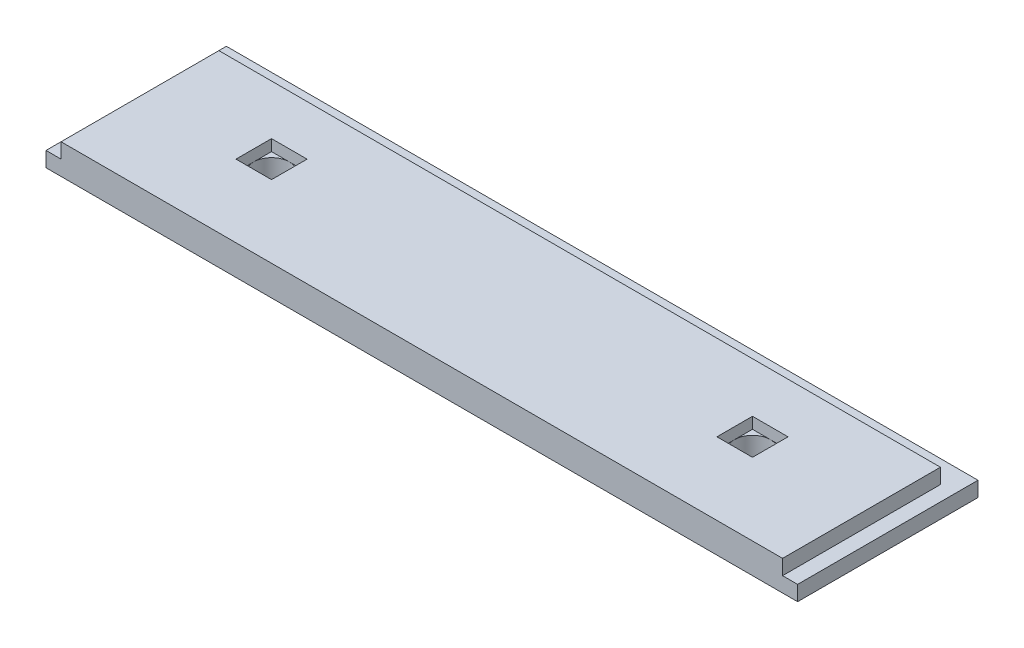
ISO-10303-21;
HEADER;
FILE_DESCRIPTION(('STEP AP214'),'2;1');
FILE_NAME('part.step','',(''),(''),'','','');
FILE_SCHEMA(('AUTOMOTIVE_DESIGN { 1 0 10303 214 1 1 1 1 }'));
ENDSEC;
DATA;
#1=APPLICATION_CONTEXT('core data for automotive mechanical design processes');
#2=APPLICATION_PROTOCOL_DEFINITION('international standard','automotive_design',2000,#1);
#3=PRODUCT_CONTEXT('',#1,'mechanical');
#4=PRODUCT('Part','Part','',(#3));
#5=PRODUCT_RELATED_PRODUCT_CATEGORY('part','',(#4));
#6=PRODUCT_DEFINITION_FORMATION('','',#4);
#7=PRODUCT_DEFINITION_CONTEXT('part definition',#1,'design');
#8=PRODUCT_DEFINITION('design','',#6,#7);
#9=PRODUCT_DEFINITION_SHAPE('','',#8);
#10=(LENGTH_UNIT() NAMED_UNIT(*) SI_UNIT(.MILLI.,.METRE.));
#11=(NAMED_UNIT(*) PLANE_ANGLE_UNIT() SI_UNIT($,.RADIAN.));
#12=(NAMED_UNIT(*) SI_UNIT($,.STERADIAN.) SOLID_ANGLE_UNIT());
#13=UNCERTAINTY_MEASURE_WITH_UNIT(LENGTH_MEASURE(1.E-05),#10,'distance_accuracy_value','');
#14=(GEOMETRIC_REPRESENTATION_CONTEXT(3) GLOBAL_UNCERTAINTY_ASSIGNED_CONTEXT((#13)) GLOBAL_UNIT_ASSIGNED_CONTEXT((#10,
#11,#12)) REPRESENTATION_CONTEXT('',''));
#15=CARTESIAN_POINT('',(0.,0.,0.));
#16=DIRECTION('',(0.,0.,1.));
#17=DIRECTION('',(1.,0.,0.));
#18=AXIS2_PLACEMENT_3D('',#15,#16,#17);
#19=CARTESIAN_POINT('',(2489.2,50.8000000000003,609.6));
#20=DIRECTION('',(-1.,0.,0.));
#21=DIRECTION('',(0.,0.,1.));
#22=AXIS2_PLACEMENT_3D('',#19,#20,#21);
#23=PLANE('',#22);
#24=DIRECTION('',(0.,-1.,0.));
#25=VECTOR('',#24,1.);
#26=CARTESIAN_POINT('',(2489.2,101.6,76.2));
#27=LINE('',#26,#25);
#28=CARTESIAN_POINT('',(2489.2,101.6,76.2));
#29=VERTEX_POINT('',#28);
#30=CARTESIAN_POINT('',(2489.2,50.8000000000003,76.2));
#31=VERTEX_POINT('',#30);
#32=EDGE_CURVE('E186',#29,#31,#27,.T.);
#33=ORIENTED_EDGE('',*,*,#32,.F.);
#34=DIRECTION('',(0.,0.,-1.));
#35=VECTOR('',#34,1.);
#36=CARTESIAN_POINT('',(2489.2,101.6,609.6));
#37=LINE('',#36,#35);
#38=CARTESIAN_POINT('',(2489.2,101.6,609.6));
#39=VERTEX_POINT('',#38);
#40=EDGE_CURVE('E195',#39,#29,#37,.T.);
#41=ORIENTED_EDGE('',*,*,#40,.F.);
#42=DIRECTION('',(0.,1.,0.));
#43=VECTOR('',#42,1.);
#44=CARTESIAN_POINT('',(2489.2,50.8000000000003,609.6));
#45=LINE('',#44,#43);
#46=CARTESIAN_POINT('',(2489.2,50.8000000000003,609.6));
#47=VERTEX_POINT('',#46);
#48=EDGE_CURVE('E193',#47,#39,#45,.T.);
#49=ORIENTED_EDGE('',*,*,#48,.F.);
#50=DIRECTION('',(0.,0.,-1.));
#51=VECTOR('',#50,1.);
#52=CARTESIAN_POINT('',(2489.2,50.8000000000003,609.6));
#53=LINE('',#52,#51);
#54=EDGE_CURVE('E175',#47,#31,#53,.T.);
#55=ORIENTED_EDGE('',*,*,#54,.T.);
#56=EDGE_LOOP('',(#33,#41,#49,#55));
#57=FACE_BOUND('',#56,.T.);
#58=ADVANCED_FACE('F32',(#57),#23,.F.);
#59=CARTESIAN_POINT('',(2489.2,101.6,609.6));
#60=DIRECTION('',(0.,-1.,0.));
#61=DIRECTION('',(1.,0.,0.));
#62=AXIS2_PLACEMENT_3D('',#59,#60,#61);
#63=PLANE('',#62);
#64=DIRECTION('',(1.,0.,0.));
#65=VECTOR('',#64,1.);
#66=CARTESIAN_POINT('',(2022.602,101.6,364.871));
#67=LINE('',#66,#65);
#68=CARTESIAN_POINT('',(2022.602,101.6,364.871));
#69=VERTEX_POINT('',#68);
#70=CARTESIAN_POINT('',(2142.744,101.6,364.871));
#71=VERTEX_POINT('',#70);
#72=EDGE_CURVE('E330',#69,#71,#67,.T.);
#73=ORIENTED_EDGE('',*,*,#72,.F.);
#74=DIRECTION('',(0.,0.,1.));
#75=VECTOR('',#74,1.);
#76=CARTESIAN_POINT('',(2022.602,101.6,244.729));
#77=LINE('',#76,#75);
#78=CARTESIAN_POINT('',(2022.602,101.6,244.729));
#79=VERTEX_POINT('',#78);
#80=EDGE_CURVE('E274',#79,#69,#77,.T.);
#81=ORIENTED_EDGE('',*,*,#80,.F.);
#82=DIRECTION('',(-1.,0.,0.));
#83=VECTOR('',#82,1.);
#84=CARTESIAN_POINT('',(2022.602,101.6,244.729));
#85=LINE('',#84,#83);
#86=CARTESIAN_POINT('',(2142.744,101.6,244.729));
#87=VERTEX_POINT('',#86);
#88=EDGE_CURVE('E336',#87,#79,#85,.T.);
#89=ORIENTED_EDGE('',*,*,#88,.F.);
#90=DIRECTION('',(0.,0.,-1.));
#91=VECTOR('',#90,1.);
#92=CARTESIAN_POINT('',(2142.744,101.6,244.729));
#93=LINE('',#92,#91);
#94=EDGE_CURVE('E333',#71,#87,#93,.T.);
#95=ORIENTED_EDGE('',*,*,#94,.F.);
#96=EDGE_LOOP('',(#73,#81,#89,#95));
#97=FACE_BOUND('',#96,.T.);
#98=DIRECTION('',(1.,0.,0.));
#99=VECTOR('',#98,1.);
#100=CARTESIAN_POINT('',(397.256,101.6,364.871));
#101=LINE('',#100,#99);
#102=CARTESIAN_POINT('',(397.256,101.6,364.871));
#103=VERTEX_POINT('',#102);
#104=CARTESIAN_POINT('',(517.398,101.6,364.871));
#105=VERTEX_POINT('',#104);
#106=EDGE_CURVE('E294',#103,#105,#101,.T.);
#107=ORIENTED_EDGE('',*,*,#106,.F.);
#108=DIRECTION('',(0.,0.,1.));
#109=VECTOR('',#108,1.);
#110=CARTESIAN_POINT('',(397.256,101.6,244.729));
#111=LINE('',#110,#109);
#112=CARTESIAN_POINT('',(397.256,101.6,244.729));
#113=VERTEX_POINT('',#112);
#114=EDGE_CURVE('E292',#113,#103,#111,.T.);
#115=ORIENTED_EDGE('',*,*,#114,.F.);
#116=DIRECTION('',(-1.,0.,0.));
#117=VECTOR('',#116,1.);
#118=CARTESIAN_POINT('',(397.256,101.6,244.729));
#119=LINE('',#118,#117);
#120=CARTESIAN_POINT('',(517.398,101.6,244.729));
#121=VERTEX_POINT('',#120);
#122=EDGE_CURVE('E301',#121,#113,#119,.T.);
#123=ORIENTED_EDGE('',*,*,#122,.F.);
#124=DIRECTION('',(0.,0.,-1.));
#125=VECTOR('',#124,1.);
#126=CARTESIAN_POINT('',(517.398,101.6,244.729));
#127=LINE('',#126,#125);
#128=EDGE_CURVE('E298',#105,#121,#127,.T.);
#129=ORIENTED_EDGE('',*,*,#128,.F.);
#130=EDGE_LOOP('',(#107,#115,#123,#129));
#131=FACE_BOUND('',#130,.T.);
#132=DIRECTION('',(1.,0.,0.));
#133=VECTOR('',#132,1.);
#134=CARTESIAN_POINT('',(0.,101.6,76.2));
#135=LINE('',#134,#133);
#136=CARTESIAN_POINT('',(50.8,101.6,76.2));
#137=VERTEX_POINT('',#136);
#138=EDGE_CURVE('E183',#137,#29,#135,.T.);
#139=ORIENTED_EDGE('',*,*,#138,.F.);
#140=DIRECTION('',(0.,0.,-1.));
#141=VECTOR('',#140,1.);
#142=CARTESIAN_POINT('',(50.8,101.6,609.6));
#143=LINE('',#142,#141);
#144=CARTESIAN_POINT('',(50.8,101.6,609.6));
#145=VERTEX_POINT('',#144);
#146=EDGE_CURVE('E200',#145,#137,#143,.T.);
#147=ORIENTED_EDGE('',*,*,#146,.F.);
#148=DIRECTION('',(-1.,0.,0.));
#149=VECTOR('',#148,1.);
#150=CARTESIAN_POINT('',(2489.2,101.6,609.6));
#151=LINE('',#150,#149);
#152=EDGE_CURVE('E252',#39,#145,#151,.T.);
#153=ORIENTED_EDGE('',*,*,#152,.F.);
#154=ORIENTED_EDGE('',*,*,#40,.T.);
#155=EDGE_LOOP('',(#139,#147,#153,#154));
#156=FACE_BOUND('',#155,.T.);
#157=ADVANCED_FACE('F251',(#97,#131,#156),#63,.F.);
#158=CARTESIAN_POINT('',(50.8,101.6,609.6));
#159=DIRECTION('',(1.,0.,0.));
#160=DIRECTION('',(0.,1.,0.));
#161=AXIS2_PLACEMENT_3D('',#158,#159,#160);
#162=PLANE('',#161);
#163=DIRECTION('',(0.,1.,0.));
#164=VECTOR('',#163,1.);
#165=CARTESIAN_POINT('',(50.8,101.6,76.2));
#166=LINE('',#165,#164);
#167=CARTESIAN_POINT('',(50.8,50.8,76.2));
#168=VERTEX_POINT('',#167);
#169=EDGE_CURVE('E182',#168,#137,#166,.T.);
#170=ORIENTED_EDGE('',*,*,#169,.F.);
#171=DIRECTION('',(0.,0.,-1.));
#172=VECTOR('',#171,1.);
#173=CARTESIAN_POINT('',(50.8,50.8,609.6));
#174=LINE('',#173,#172);
#175=CARTESIAN_POINT('',(50.8,50.8,609.6));
#176=VERTEX_POINT('',#175);
#177=EDGE_CURVE('E179',#176,#168,#174,.T.);
#178=ORIENTED_EDGE('',*,*,#177,.F.);
#179=DIRECTION('',(0.,-1.,0.));
#180=VECTOR('',#179,1.);
#181=CARTESIAN_POINT('',(50.8,101.6,609.6));
#182=LINE('',#181,#180);
#183=EDGE_CURVE('E248',#145,#176,#182,.T.);
#184=ORIENTED_EDGE('',*,*,#183,.F.);
#185=ORIENTED_EDGE('',*,*,#146,.T.);
#186=EDGE_LOOP('',(#170,#178,#184,#185));
#187=FACE_BOUND('',#186,.T.);
#188=ADVANCED_FACE('F247',(#187),#162,.F.);
#189=CARTESIAN_POINT('',(0.,0.,0.));
#190=DIRECTION('',(0.,0.,1.));
#191=DIRECTION('',(1.,0.,0.));
#192=AXIS2_PLACEMENT_3D('',#189,#190,#191);
#193=PLANE('',#192);
#194=DIRECTION('',(-1.,0.,0.));
#195=VECTOR('',#194,1.);
#196=CARTESIAN_POINT('',(50.8,50.8,0.));
#197=LINE('',#196,#195);
#198=CARTESIAN_POINT('',(2540.,50.8000000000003,0.));
#199=VERTEX_POINT('',#198);
#200=CARTESIAN_POINT('',(0.,50.8,0.));
#201=VERTEX_POINT('',#200);
#202=EDGE_CURVE('E234',#199,#201,#197,.T.);
#203=ORIENTED_EDGE('',*,*,#202,.F.);
#204=DIRECTION('',(0.,1.,0.));
#205=VECTOR('',#204,1.);
#206=CARTESIAN_POINT('',(2540.,0.,0.));
#207=LINE('',#206,#205);
#208=CARTESIAN_POINT('',(2540.,0.,0.));
#209=VERTEX_POINT('',#208);
#210=EDGE_CURVE('E226',#209,#199,#207,.T.);
#211=ORIENTED_EDGE('',*,*,#210,.F.);
#212=DIRECTION('',(1.,0.,0.));
#213=VECTOR('',#212,1.);
#214=CARTESIAN_POINT('',(0.,0.,0.));
#215=LINE('',#214,#213);
#216=CARTESIAN_POINT('',(0.,0.,0.));
#217=VERTEX_POINT('',#216);
#218=EDGE_CURVE('E219',#217,#209,#215,.T.);
#219=ORIENTED_EDGE('',*,*,#218,.F.);
#220=DIRECTION('',(0.,-1.,0.));
#221=VECTOR('',#220,1.);
#222=CARTESIAN_POINT('',(0.,50.8,0.));
#223=LINE('',#222,#221);
#224=EDGE_CURVE('E227',#201,#217,#223,.T.);
#225=ORIENTED_EDGE('',*,*,#224,.F.);
#226=EDGE_LOOP('',(#203,#211,#219,#225));
#227=FACE_BOUND('',#226,.T.);
#228=ADVANCED_FACE('F233',(#227),#193,.F.);
#229=CARTESIAN_POINT('',(0.,63.5,0.));
#230=DIRECTION('',(0.,1.,0.));
#231=DIRECTION('',(-1.,0.,0.));
#232=AXIS2_PLACEMENT_3D('',#229,#230,#231);
#233=PLANE('',#232);
#234=DIRECTION('',(0.,0.,1.));
#235=VECTOR('',#234,1.);
#236=CARTESIAN_POINT('',(2022.602,63.5000000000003,244.729));
#237=LINE('',#236,#235);
#238=CARTESIAN_POINT('',(2022.602,63.5000000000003,244.729));
#239=VERTEX_POINT('',#238);
#240=CARTESIAN_POINT('',(2022.602,63.5000000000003,304.8));
#241=VERTEX_POINT('',#240);
#242=EDGE_CURVE('E312',#239,#241,#237,.T.);
#243=ORIENTED_EDGE('',*,*,#242,.T.);
#244=CARTESIAN_POINT('',(2082.673,63.5000000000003,304.8));
#245=DIRECTION('',(0.,1.,0.));
#246=DIRECTION('',(-1.,0.,0.));
#247=AXIS2_PLACEMENT_3D('',#244,#245,#246);
#248=CIRCLE('',#247,60.0710000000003);
#249=CARTESIAN_POINT('',(2082.673,63.5000000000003,244.729));
#250=VERTEX_POINT('',#249);
#251=EDGE_CURVE('E47',#241,#250,#248,.F.);
#252=ORIENTED_EDGE('',*,*,#251,.T.);
#253=DIRECTION('',(-1.,0.,0.));
#254=VECTOR('',#253,1.);
#255=CARTESIAN_POINT('',(2022.602,63.5000000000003,244.729));
#256=LINE('',#255,#254);
#257=EDGE_CURVE('E324',#250,#239,#256,.T.);
#258=ORIENTED_EDGE('',*,*,#257,.T.);
#259=EDGE_LOOP('',(#243,#252,#258));
#260=FACE_BOUND('',#259,.T.);
#261=ADVANCED_FACE('F505',(#260),#233,.T.);
#262=CARTESIAN_POINT('',(2142.744,63.5000000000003,244.729));
#263=VERTEX_POINT('',#262);
#264=EDGE_CURVE('E325',#263,#250,#256,.T.);
#265=ORIENTED_EDGE('',*,*,#264,.T.);
#266=CARTESIAN_POINT('',(2142.744,63.5000000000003,304.8));
#267=VERTEX_POINT('',#266);
#268=EDGE_CURVE('E268',#250,#267,#248,.F.);
#269=ORIENTED_EDGE('',*,*,#268,.T.);
#270=DIRECTION('',(0.,0.,-1.));
#271=VECTOR('',#270,1.);
#272=CARTESIAN_POINT('',(2142.744,63.5000000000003,244.729));
#273=LINE('',#272,#271);
#274=EDGE_CURVE('E320',#267,#263,#273,.T.);
#275=ORIENTED_EDGE('',*,*,#274,.T.);
#276=EDGE_LOOP('',(#265,#269,#275));
#277=FACE_BOUND('',#276,.T.);
#278=ADVANCED_FACE('F567',(#277),#233,.T.);
#279=CARTESIAN_POINT('',(2142.744,63.5000000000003,364.871));
#280=VERTEX_POINT('',#279);
#281=EDGE_CURVE('E321',#280,#267,#273,.T.);
#282=ORIENTED_EDGE('',*,*,#281,.T.);
#283=CARTESIAN_POINT('',(2082.673,63.5000000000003,364.871));
#284=VERTEX_POINT('',#283);
#285=EDGE_CURVE('E637',#267,#284,#248,.F.);
#286=ORIENTED_EDGE('',*,*,#285,.T.);
#287=DIRECTION('',(1.,0.,0.));
#288=VECTOR('',#287,1.);
#289=CARTESIAN_POINT('',(2022.602,63.5000000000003,364.871));
#290=LINE('',#289,#288);
#291=EDGE_CURVE('E315',#284,#280,#290,.T.);
#292=ORIENTED_EDGE('',*,*,#291,.T.);
#293=EDGE_LOOP('',(#282,#286,#292));
#294=FACE_BOUND('',#293,.T.);
#295=ADVANCED_FACE('F506',(#294),#233,.T.);
#296=CARTESIAN_POINT('',(0.,63.5,0.));
#297=DIRECTION('',(0.,1.,0.));
#298=DIRECTION('',(-1.,0.,0.));
#299=AXIS2_PLACEMENT_3D('',#296,#297,#298);
#300=PLANE('',#299);
#301=DIRECTION('',(0.,0.,1.));
#302=VECTOR('',#301,1.);
#303=CARTESIAN_POINT('',(397.256,63.5000000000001,244.729));
#304=LINE('',#303,#302);
#305=CARTESIAN_POINT('',(397.256,63.5000000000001,244.729));
#306=VERTEX_POINT('',#305);
#307=CARTESIAN_POINT('',(397.256,63.5000000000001,304.8));
#308=VERTEX_POINT('',#307);
#309=EDGE_CURVE('E275',#306,#308,#304,.T.);
#310=ORIENTED_EDGE('',*,*,#309,.T.);
#311=CARTESIAN_POINT('',(457.327,63.5000000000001,304.8));
#312=DIRECTION('',(0.,1.,0.));
#313=DIRECTION('',(-1.,0.,0.));
#314=AXIS2_PLACEMENT_3D('',#311,#312,#313);
#315=CIRCLE('',#314,60.0709999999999);
#316=CARTESIAN_POINT('',(457.327,63.5000000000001,244.729));
#317=VERTEX_POINT('',#316);
#318=EDGE_CURVE('E55',#308,#317,#315,.F.);
#319=ORIENTED_EDGE('',*,*,#318,.T.);
#320=DIRECTION('',(-1.,0.,0.));
#321=VECTOR('',#320,1.);
#322=CARTESIAN_POINT('',(397.256,63.5000000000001,244.729));
#323=LINE('',#322,#321);
#324=EDGE_CURVE('E287',#317,#306,#323,.T.);
#325=ORIENTED_EDGE('',*,*,#324,.T.);
#326=EDGE_LOOP('',(#310,#319,#325));
#327=FACE_BOUND('',#326,.T.);
#328=ADVANCED_FACE('F463',(#327),#300,.T.);
#329=CARTESIAN_POINT('',(517.398,63.5000000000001,244.729));
#330=VERTEX_POINT('',#329);
#331=EDGE_CURVE('E288',#330,#317,#323,.T.);
#332=ORIENTED_EDGE('',*,*,#331,.T.);
#333=CARTESIAN_POINT('',(517.398,63.5000000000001,304.8));
#334=VERTEX_POINT('',#333);
#335=EDGE_CURVE('E263',#317,#334,#315,.F.);
#336=ORIENTED_EDGE('',*,*,#335,.T.);
#337=DIRECTION('',(0.,0.,-1.));
#338=VECTOR('',#337,1.);
#339=CARTESIAN_POINT('',(517.398,63.5000000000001,244.729));
#340=LINE('',#339,#338);
#341=EDGE_CURVE('E283',#334,#330,#340,.T.);
#342=ORIENTED_EDGE('',*,*,#341,.T.);
#343=EDGE_LOOP('',(#332,#336,#342));
#344=FACE_BOUND('',#343,.T.);
#345=ADVANCED_FACE('F542',(#344),#300,.T.);
#346=CARTESIAN_POINT('',(517.398,63.5000000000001,364.871));
#347=VERTEX_POINT('',#346);
#348=EDGE_CURVE('E284',#347,#334,#340,.T.);
#349=ORIENTED_EDGE('',*,*,#348,.T.);
#350=CARTESIAN_POINT('',(457.327,63.5000000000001,364.871));
#351=VERTEX_POINT('',#350);
#352=EDGE_CURVE('E667',#334,#351,#315,.F.);
#353=ORIENTED_EDGE('',*,*,#352,.T.);
#354=DIRECTION('',(1.,0.,0.));
#355=VECTOR('',#354,1.);
#356=CARTESIAN_POINT('',(397.256,63.5000000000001,364.871));
#357=LINE('',#356,#355);
#358=EDGE_CURVE('E278',#351,#347,#357,.T.);
#359=ORIENTED_EDGE('',*,*,#358,.T.);
#360=EDGE_LOOP('',(#349,#353,#359));
#361=FACE_BOUND('',#360,.T.);
#362=ADVANCED_FACE('F464',(#361),#300,.T.);
#363=CARTESIAN_POINT('',(0.,50.8,609.6));
#364=DIRECTION('',(1.,0.,0.));
#365=DIRECTION('',(0.,1.,0.));
#366=AXIS2_PLACEMENT_3D('',#363,#364,#365);
#367=PLANE('',#366);
#368=ORIENTED_EDGE('',*,*,#224,.T.);
#369=DIRECTION('',(0.,0.,-1.));
#370=VECTOR('',#369,1.);
#371=CARTESIAN_POINT('',(0.,0.,609.6));
#372=LINE('',#371,#370);
#373=CARTESIAN_POINT('',(0.,0.,609.6));
#374=VERTEX_POINT('',#373);
#375=EDGE_CURVE('E206',#374,#217,#372,.T.);
#376=ORIENTED_EDGE('',*,*,#375,.F.);
#377=DIRECTION('',(0.,-1.,0.));
#378=VECTOR('',#377,1.);
#379=CARTESIAN_POINT('',(0.,50.8,609.6));
#380=LINE('',#379,#378);
#381=CARTESIAN_POINT('',(0.,50.8,609.6));
#382=VERTEX_POINT('',#381);
#383=EDGE_CURVE('E236',#382,#374,#380,.T.);
#384=ORIENTED_EDGE('',*,*,#383,.F.);
#385=DIRECTION('',(0.,0.,-1.));
#386=VECTOR('',#385,1.);
#387=CARTESIAN_POINT('',(0.,50.8,609.6));
#388=LINE('',#387,#386);
#389=EDGE_CURVE('E240',#382,#201,#388,.T.);
#390=ORIENTED_EDGE('',*,*,#389,.T.);
#391=EDGE_LOOP('',(#368,#376,#384,#390));
#392=FACE_BOUND('',#391,.T.);
#393=ADVANCED_FACE('F34',(#392),#367,.F.);
#394=CARTESIAN_POINT('',(0.,0.,609.6));
#395=DIRECTION('',(0.,1.,0.));
#396=DIRECTION('',(0.,0.,1.));
#397=AXIS2_PLACEMENT_3D('',#394,#395,#396);
#398=PLANE('',#397);
#399=CARTESIAN_POINT('',(2082.8,0.,304.8));
#400=DIRECTION('',(0.,1.,0.));
#401=DIRECTION('',(0.,0.,1.));
#402=AXIS2_PLACEMENT_3D('',#399,#400,#401);
#403=CIRCLE('',#402,76.2000000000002);
#404=CARTESIAN_POINT('',(2082.8,0.,381.));
#405=VERTEX_POINT('',#404);
#406=EDGE_CURVE('E11',#405,#405,#403,.F.);
#407=ORIENTED_EDGE('',*,*,#406,.F.);
#408=EDGE_LOOP('',(#407));
#409=FACE_BOUND('',#408,.T.);
#410=CARTESIAN_POINT('',(457.2,0.,304.8));
#411=DIRECTION('',(0.,1.,0.));
#412=DIRECTION('',(0.,0.,1.));
#413=AXIS2_PLACEMENT_3D('',#410,#411,#412);
#414=CIRCLE('',#413,76.2000000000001);
#415=CARTESIAN_POINT('',(457.2,0.,381.));
#416=VERTEX_POINT('',#415);
#417=EDGE_CURVE('E40',#416,#416,#414,.F.);
#418=ORIENTED_EDGE('',*,*,#417,.F.);
#419=EDGE_LOOP('',(#418));
#420=FACE_BOUND('',#419,.T.);
#421=ORIENTED_EDGE('',*,*,#218,.T.);
#422=DIRECTION('',(0.,0.,-1.));
#423=VECTOR('',#422,1.);
#424=CARTESIAN_POINT('',(2540.,0.,609.6));
#425=LINE('',#424,#423);
#426=CARTESIAN_POINT('',(2540.,0.,609.6));
#427=VERTEX_POINT('',#426);
#428=EDGE_CURVE('E198',#427,#209,#425,.T.);
#429=ORIENTED_EDGE('',*,*,#428,.F.);
#430=DIRECTION('',(1.,0.,0.));
#431=VECTOR('',#430,1.);
#432=CARTESIAN_POINT('',(0.,0.,609.6));
#433=LINE('',#432,#431);
#434=EDGE_CURVE('E348',#374,#427,#433,.T.);
#435=ORIENTED_EDGE('',*,*,#434,.F.);
#436=ORIENTED_EDGE('',*,*,#375,.T.);
#437=EDGE_LOOP('',(#421,#429,#435,#436));
#438=FACE_BOUND('',#437,.T.);
#439=ADVANCED_FACE('F213',(#409,#420,#438),#398,.F.);
#440=CARTESIAN_POINT('',(2540.,0.,609.6));
#441=DIRECTION('',(-1.,0.,0.));
#442=DIRECTION('',(0.,0.,1.));
#443=AXIS2_PLACEMENT_3D('',#440,#441,#442);
#444=PLANE('',#443);
#445=ORIENTED_EDGE('',*,*,#210,.T.);
#446=DIRECTION('',(0.,0.,-1.));
#447=VECTOR('',#446,1.);
#448=CARTESIAN_POINT('',(2540.,50.8000000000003,609.6));
#449=LINE('',#448,#447);
#450=CARTESIAN_POINT('',(2540.,50.8000000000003,609.6));
#451=VERTEX_POINT('',#450);
#452=EDGE_CURVE('E194',#451,#199,#449,.T.);
#453=ORIENTED_EDGE('',*,*,#452,.F.);
#454=DIRECTION('',(0.,1.,0.));
#455=VECTOR('',#454,1.);
#456=CARTESIAN_POINT('',(2540.,0.,609.6));
#457=LINE('',#456,#455);
#458=EDGE_CURVE('E232',#427,#451,#457,.T.);
#459=ORIENTED_EDGE('',*,*,#458,.F.);
#460=ORIENTED_EDGE('',*,*,#428,.T.);
#461=EDGE_LOOP('',(#445,#453,#459,#460));
#462=FACE_BOUND('',#461,.T.);
#463=ADVANCED_FACE('F216',(#462),#444,.F.);
#464=CARTESIAN_POINT('',(50.8,50.8,609.6));
#465=DIRECTION('',(0.,-1.,0.));
#466=DIRECTION('',(1.,0.,0.));
#467=AXIS2_PLACEMENT_3D('',#464,#465,#466);
#468=PLANE('',#467);
#469=ORIENTED_EDGE('',*,*,#202,.T.);
#470=ORIENTED_EDGE('',*,*,#389,.F.);
#471=DIRECTION('',(-1.,0.,0.));
#472=VECTOR('',#471,1.);
#473=CARTESIAN_POINT('',(50.8,50.8,609.6));
#474=LINE('',#473,#472);
#475=EDGE_CURVE('E242',#176,#382,#474,.T.);
#476=ORIENTED_EDGE('',*,*,#475,.F.);
#477=ORIENTED_EDGE('',*,*,#177,.T.);
#478=DIRECTION('',(1.,0.,0.));
#479=VECTOR('',#478,1.);
#480=CARTESIAN_POINT('',(0.,50.8,76.2));
#481=LINE('',#480,#479);
#482=EDGE_CURVE('E169',#168,#31,#481,.T.);
#483=ORIENTED_EDGE('',*,*,#482,.T.);
#484=ORIENTED_EDGE('',*,*,#54,.F.);
#485=DIRECTION('',(-1.,0.,0.));
#486=VECTOR('',#485,1.);
#487=CARTESIAN_POINT('',(2540.,50.8000000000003,609.6));
#488=LINE('',#487,#486);
#489=EDGE_CURVE('E351',#451,#47,#488,.T.);
#490=ORIENTED_EDGE('',*,*,#489,.F.);
#491=ORIENTED_EDGE('',*,*,#452,.T.);
#492=EDGE_LOOP('',(#469,#470,#476,#477,#483,#484,#490,#491));
#493=FACE_BOUND('',#492,.T.);
#494=ADVANCED_FACE('F172',(#493),#468,.F.);
#495=CARTESIAN_POINT('',(0.,0.,609.6));
#496=DIRECTION('',(0.,0.,1.));
#497=DIRECTION('',(1.,0.,0.));
#498=AXIS2_PLACEMENT_3D('',#495,#496,#497);
#499=PLANE('',#498);
#500=ORIENTED_EDGE('',*,*,#383,.T.);
#501=ORIENTED_EDGE('',*,*,#434,.T.);
#502=ORIENTED_EDGE('',*,*,#458,.T.);
#503=ORIENTED_EDGE('',*,*,#489,.T.);
#504=ORIENTED_EDGE('',*,*,#48,.T.);
#505=ORIENTED_EDGE('',*,*,#152,.T.);
#506=ORIENTED_EDGE('',*,*,#183,.T.);
#507=ORIENTED_EDGE('',*,*,#475,.T.);
#508=EDGE_LOOP('',(#500,#501,#502,#503,#504,#505,#506,#507));
#509=FACE_BOUND('',#508,.T.);
#510=ADVANCED_FACE('F360',(#509),#499,.T.);
#511=CARTESIAN_POINT('',(2022.602,63.5000000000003,244.729));
#512=DIRECTION('',(-1.,0.,0.));
#513=DIRECTION('',(0.,-1.,0.));
#514=AXIS2_PLACEMENT_3D('',#511,#512,#513);
#515=PLANE('',#514);
#516=ORIENTED_EDGE('',*,*,#80,.T.);
#517=DIRECTION('',(0.,1.,0.));
#518=VECTOR('',#517,1.);
#519=CARTESIAN_POINT('',(2022.602,63.5000000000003,364.871));
#520=LINE('',#519,#518);
#521=CARTESIAN_POINT('',(2022.602,63.5000000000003,364.871));
#522=VERTEX_POINT('',#521);
#523=EDGE_CURVE('E328',#522,#69,#520,.T.);
#524=ORIENTED_EDGE('',*,*,#523,.F.);
#525=EDGE_CURVE('E316',#241,#522,#237,.T.);
#526=ORIENTED_EDGE('',*,*,#525,.F.);
#527=ORIENTED_EDGE('',*,*,#242,.F.);
#528=DIRECTION('',(0.,1.,0.));
#529=VECTOR('',#528,1.);
#530=CARTESIAN_POINT('',(2022.602,63.5000000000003,244.729));
#531=LINE('',#530,#529);
#532=EDGE_CURVE('E295',#239,#79,#531,.T.);
#533=ORIENTED_EDGE('',*,*,#532,.T.);
#534=EDGE_LOOP('',(#516,#524,#526,#527,#533));
#535=FACE_BOUND('',#534,.T.);
#536=ADVANCED_FACE('F362',(#535),#515,.F.);
#537=CARTESIAN_POINT('',(2022.602,63.5000000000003,244.729));
#538=DIRECTION('',(0.,0.,-1.));
#539=DIRECTION('',(-1.,0.,0.));
#540=AXIS2_PLACEMENT_3D('',#537,#538,#539);
#541=PLANE('',#540);
#542=ORIENTED_EDGE('',*,*,#88,.T.);
#543=ORIENTED_EDGE('',*,*,#532,.F.);
#544=ORIENTED_EDGE('',*,*,#257,.F.);
#545=ORIENTED_EDGE('',*,*,#264,.F.);
#546=DIRECTION('',(0.,1.,0.));
#547=VECTOR('',#546,1.);
#548=CARTESIAN_POINT('',(2142.744,63.5000000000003,244.729));
#549=LINE('',#548,#547);
#550=EDGE_CURVE('E340',#263,#87,#549,.T.);
#551=ORIENTED_EDGE('',*,*,#550,.T.);
#552=EDGE_LOOP('',(#542,#543,#544,#545,#551));
#553=FACE_BOUND('',#552,.T.);
#554=ADVANCED_FACE('F368',(#553),#541,.F.);
#555=CARTESIAN_POINT('',(2142.744,63.5000000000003,244.729));
#556=DIRECTION('',(1.,0.,0.));
#557=DIRECTION('',(0.,1.,0.));
#558=AXIS2_PLACEMENT_3D('',#555,#556,#557);
#559=PLANE('',#558);
#560=ORIENTED_EDGE('',*,*,#94,.T.);
#561=ORIENTED_EDGE('',*,*,#550,.F.);
#562=ORIENTED_EDGE('',*,*,#274,.F.);
#563=ORIENTED_EDGE('',*,*,#281,.F.);
#564=DIRECTION('',(0.,1.,0.));
#565=VECTOR('',#564,1.);
#566=CARTESIAN_POINT('',(2142.744,63.5000000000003,364.871));
#567=LINE('',#566,#565);
#568=EDGE_CURVE('E342',#280,#71,#567,.T.);
#569=ORIENTED_EDGE('',*,*,#568,.T.);
#570=EDGE_LOOP('',(#560,#561,#562,#563,#569));
#571=FACE_BOUND('',#570,.T.);
#572=ADVANCED_FACE('F512',(#571),#559,.F.);
#573=CARTESIAN_POINT('',(2022.602,63.5000000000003,364.871));
#574=DIRECTION('',(0.,0.,1.));
#575=DIRECTION('',(1.,0.,0.));
#576=AXIS2_PLACEMENT_3D('',#573,#574,#575);
#577=PLANE('',#576);
#578=ORIENTED_EDGE('',*,*,#72,.T.);
#579=ORIENTED_EDGE('',*,*,#568,.F.);
#580=ORIENTED_EDGE('',*,*,#291,.F.);
#581=EDGE_CURVE('E317',#522,#284,#290,.T.);
#582=ORIENTED_EDGE('',*,*,#581,.F.);
#583=ORIENTED_EDGE('',*,*,#523,.T.);
#584=EDGE_LOOP('',(#578,#579,#580,#582,#583));
#585=FACE_BOUND('',#584,.T.);
#586=ADVANCED_FACE('F502',(#585),#577,.F.);
#587=ORIENTED_EDGE('',*,*,#581,.T.);
#588=EDGE_CURVE('E266',#284,#241,#248,.F.);
#589=ORIENTED_EDGE('',*,*,#588,.T.);
#590=ORIENTED_EDGE('',*,*,#525,.T.);
#591=EDGE_LOOP('',(#587,#589,#590));
#592=FACE_BOUND('',#591,.T.);
#593=ADVANCED_FACE('F494',(#592),#233,.T.);
#594=CARTESIAN_POINT('',(397.256,63.5000000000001,244.729));
#595=DIRECTION('',(-1.,0.,0.));
#596=DIRECTION('',(0.,-1.,0.));
#597=AXIS2_PLACEMENT_3D('',#594,#595,#596);
#598=PLANE('',#597);
#599=ORIENTED_EDGE('',*,*,#114,.T.);
#600=DIRECTION('',(0.,1.,0.));
#601=VECTOR('',#600,1.);
#602=CARTESIAN_POINT('',(397.256,63.5000000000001,364.871));
#603=LINE('',#602,#601);
#604=CARTESIAN_POINT('',(397.256,63.5000000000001,364.871));
#605=VERTEX_POINT('',#604);
#606=EDGE_CURVE('E291',#605,#103,#603,.T.);
#607=ORIENTED_EDGE('',*,*,#606,.F.);
#608=EDGE_CURVE('E279',#308,#605,#304,.T.);
#609=ORIENTED_EDGE('',*,*,#608,.F.);
#610=ORIENTED_EDGE('',*,*,#309,.F.);
#611=DIRECTION('',(0.,1.,0.));
#612=VECTOR('',#611,1.);
#613=CARTESIAN_POINT('',(397.256,63.5000000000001,244.729));
#614=LINE('',#613,#612);
#615=EDGE_CURVE('E304',#306,#113,#614,.T.);
#616=ORIENTED_EDGE('',*,*,#615,.T.);
#617=EDGE_LOOP('',(#599,#607,#609,#610,#616));
#618=FACE_BOUND('',#617,.T.);
#619=ADVANCED_FACE('F486',(#618),#598,.F.);
#620=CARTESIAN_POINT('',(397.256,63.5000000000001,244.729));
#621=DIRECTION('',(0.,0.,-1.));
#622=DIRECTION('',(-1.,0.,0.));
#623=AXIS2_PLACEMENT_3D('',#620,#621,#622);
#624=PLANE('',#623);
#625=ORIENTED_EDGE('',*,*,#122,.T.);
#626=ORIENTED_EDGE('',*,*,#615,.F.);
#627=ORIENTED_EDGE('',*,*,#324,.F.);
#628=ORIENTED_EDGE('',*,*,#331,.F.);
#629=DIRECTION('',(0.,1.,0.));
#630=VECTOR('',#629,1.);
#631=CARTESIAN_POINT('',(517.398,63.5000000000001,244.729));
#632=LINE('',#631,#630);
#633=EDGE_CURVE('E306',#330,#121,#632,.T.);
#634=ORIENTED_EDGE('',*,*,#633,.T.);
#635=EDGE_LOOP('',(#625,#626,#627,#628,#634));
#636=FACE_BOUND('',#635,.T.);
#637=ADVANCED_FACE('F478',(#636),#624,.F.);
#638=CARTESIAN_POINT('',(517.398,63.5000000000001,244.729));
#639=DIRECTION('',(1.,0.,0.));
#640=DIRECTION('',(0.,0.,-1.));
#641=AXIS2_PLACEMENT_3D('',#638,#639,#640);
#642=PLANE('',#641);
#643=ORIENTED_EDGE('',*,*,#128,.T.);
#644=ORIENTED_EDGE('',*,*,#633,.F.);
#645=ORIENTED_EDGE('',*,*,#341,.F.);
#646=ORIENTED_EDGE('',*,*,#348,.F.);
#647=DIRECTION('',(0.,1.,0.));
#648=VECTOR('',#647,1.);
#649=CARTESIAN_POINT('',(517.398,63.5000000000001,364.871));
#650=LINE('',#649,#648);
#651=EDGE_CURVE('E308',#347,#105,#650,.T.);
#652=ORIENTED_EDGE('',*,*,#651,.T.);
#653=EDGE_LOOP('',(#643,#644,#645,#646,#652));
#654=FACE_BOUND('',#653,.T.);
#655=ADVANCED_FACE('F470',(#654),#642,.F.);
#656=CARTESIAN_POINT('',(397.256,63.5000000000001,364.871));
#657=DIRECTION('',(0.,0.,1.));
#658=DIRECTION('',(1.,0.,0.));
#659=AXIS2_PLACEMENT_3D('',#656,#657,#658);
#660=PLANE('',#659);
#661=ORIENTED_EDGE('',*,*,#106,.T.);
#662=ORIENTED_EDGE('',*,*,#651,.F.);
#663=ORIENTED_EDGE('',*,*,#358,.F.);
#664=EDGE_CURVE('E280',#605,#351,#357,.T.);
#665=ORIENTED_EDGE('',*,*,#664,.F.);
#666=ORIENTED_EDGE('',*,*,#606,.T.);
#667=EDGE_LOOP('',(#661,#662,#663,#665,#666));
#668=FACE_BOUND('',#667,.T.);
#669=ADVANCED_FACE('F460',(#668),#660,.F.);
#670=ORIENTED_EDGE('',*,*,#664,.T.);
#671=EDGE_CURVE('E260',#351,#308,#315,.F.);
#672=ORIENTED_EDGE('',*,*,#671,.T.);
#673=ORIENTED_EDGE('',*,*,#608,.T.);
#674=EDGE_LOOP('',(#670,#672,#673));
#675=FACE_BOUND('',#674,.T.);
#676=ADVANCED_FACE('F453',(#675),#300,.T.);
#677=CARTESIAN_POINT('',(457.2,-177.8,304.8));
#678=DIRECTION('',(0.,1.,0.));
#679=DIRECTION('',(0.,0.,1.));
#680=AXIS2_PLACEMENT_3D('',#677,#678,#679);
#681=CYLINDRICAL_SURFACE('',#680,76.2000000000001);
#682=CARTESIAN_POINT('',(457.2,-177.8,304.8));
#683=DIRECTION('',(0.,-1.,0.));
#684=DIRECTION('',(0.,0.,-1.));
#685=AXIS2_PLACEMENT_3D('',#682,#683,#684);
#686=CIRCLE('',#685,76.2000000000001);
#687=CARTESIAN_POINT('',(457.2,-177.8,228.6));
#688=VERTEX_POINT('',#687);
#689=EDGE_CURVE('E271',#688,#688,#686,.T.);
#690=ORIENTED_EDGE('',*,*,#689,.F.);
#691=EDGE_LOOP('',(#690));
#692=FACE_BOUND('',#691,.T.);
#693=ORIENTED_EDGE('',*,*,#417,.T.);
#694=EDGE_LOOP('',(#693));
#695=FACE_BOUND('',#694,.T.);
#696=ADVANCED_FACE('F211',(#692,#695),#681,.T.);
#697=CARTESIAN_POINT('',(457.2,-177.8,304.8));
#698=DIRECTION('',(0.,-1.,0.));
#699=DIRECTION('',(0.,0.,-1.));
#700=AXIS2_PLACEMENT_3D('',#697,#698,#699);
#701=PLANE('',#700);
#702=CARTESIAN_POINT('',(457.327,-177.8,304.8));
#703=DIRECTION('',(0.,-1.,0.));
#704=DIRECTION('',(0.,0.,-1.));
#705=AXIS2_PLACEMENT_3D('',#702,#703,#704);
#706=CIRCLE('',#705,60.0709999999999);
#707=CARTESIAN_POINT('',(457.327,-177.8,244.729));
#708=VERTEX_POINT('',#707);
#709=EDGE_CURVE('E257',#708,#708,#706,.F.);
#710=ORIENTED_EDGE('',*,*,#709,.T.);
#711=EDGE_LOOP('',(#710));
#712=FACE_BOUND('',#711,.T.);
#713=ORIENTED_EDGE('',*,*,#689,.T.);
#714=EDGE_LOOP('',(#713));
#715=FACE_BOUND('',#714,.T.);
#716=ADVANCED_FACE('F437',(#712,#715),#701,.T.);
#717=CARTESIAN_POINT('',(2082.8,-177.8,304.8));
#718=DIRECTION('',(0.,1.,0.));
#719=DIRECTION('',(0.,0.,1.));
#720=AXIS2_PLACEMENT_3D('',#717,#718,#719);
#721=CYLINDRICAL_SURFACE('',#720,76.2000000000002);
#722=CARTESIAN_POINT('',(2082.8,-177.8,304.8));
#723=DIRECTION('',(0.,-1.,0.));
#724=DIRECTION('',(0.,0.,-1.));
#725=AXIS2_PLACEMENT_3D('',#722,#723,#724);
#726=CIRCLE('',#725,76.2000000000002);
#727=CARTESIAN_POINT('',(2082.8,-177.8,228.6));
#728=VERTEX_POINT('',#727);
#729=EDGE_CURVE('E262',#728,#728,#726,.T.);
#730=ORIENTED_EDGE('',*,*,#729,.F.);
#731=EDGE_LOOP('',(#730));
#732=FACE_BOUND('',#731,.T.);
#733=ORIENTED_EDGE('',*,*,#406,.T.);
#734=EDGE_LOOP('',(#733));
#735=FACE_BOUND('',#734,.T.);
#736=ADVANCED_FACE('F428',(#732,#735),#721,.T.);
#737=CARTESIAN_POINT('',(2082.8,-177.8,304.8));
#738=DIRECTION('',(0.,-1.,0.));
#739=DIRECTION('',(0.,0.,-1.));
#740=AXIS2_PLACEMENT_3D('',#737,#738,#739);
#741=PLANE('',#740);
#742=CARTESIAN_POINT('',(2082.673,-177.8,304.8));
#743=DIRECTION('',(0.,-1.,0.));
#744=DIRECTION('',(0.,0.,-1.));
#745=AXIS2_PLACEMENT_3D('',#742,#743,#744);
#746=CIRCLE('',#745,60.0710000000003);
#747=CARTESIAN_POINT('',(2082.673,-177.8,244.729));
#748=VERTEX_POINT('',#747);
#749=EDGE_CURVE('E256',#748,#748,#746,.F.);
#750=ORIENTED_EDGE('',*,*,#749,.T.);
#751=EDGE_LOOP('',(#750));
#752=FACE_BOUND('',#751,.T.);
#753=ORIENTED_EDGE('',*,*,#729,.T.);
#754=EDGE_LOOP('',(#753));
#755=FACE_BOUND('',#754,.T.);
#756=ADVANCED_FACE('F421',(#752,#755),#741,.T.);
#757=CARTESIAN_POINT('',(2082.673,-177.801,304.8));
#758=DIRECTION('',(0.,1.,0.));
#759=DIRECTION('',(-1.,0.,0.));
#760=AXIS2_PLACEMENT_3D('',#757,#758,#759);
#761=CYLINDRICAL_SURFACE('',#760,60.0710000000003);
#762=ORIENTED_EDGE('',*,*,#251,.F.);
#763=ORIENTED_EDGE('',*,*,#588,.F.);
#764=ORIENTED_EDGE('',*,*,#285,.F.);
#765=ORIENTED_EDGE('',*,*,#268,.F.);
#766=EDGE_LOOP('',(#762,#763,#764,#765));
#767=FACE_BOUND('',#766,.T.);
#768=ORIENTED_EDGE('',*,*,#749,.F.);
#769=EDGE_LOOP('',(#768));
#770=FACE_BOUND('',#769,.T.);
#771=ADVANCED_FACE('F414',(#767,#770),#761,.F.);
#772=CARTESIAN_POINT('',(457.327,-177.801,304.8));
#773=DIRECTION('',(0.,1.,0.));
#774=DIRECTION('',(-1.,0.,0.));
#775=AXIS2_PLACEMENT_3D('',#772,#773,#774);
#776=CYLINDRICAL_SURFACE('',#775,60.0709999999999);
#777=ORIENTED_EDGE('',*,*,#318,.F.);
#778=ORIENTED_EDGE('',*,*,#671,.F.);
#779=ORIENTED_EDGE('',*,*,#352,.F.);
#780=ORIENTED_EDGE('',*,*,#335,.F.);
#781=EDGE_LOOP('',(#777,#778,#779,#780));
#782=FACE_BOUND('',#781,.T.);
#783=ORIENTED_EDGE('',*,*,#709,.F.);
#784=EDGE_LOOP('',(#783));
#785=FACE_BOUND('',#784,.T.);
#786=ADVANCED_FACE('F405',(#782,#785),#776,.F.);
#787=CARTESIAN_POINT('',(0.,101.6,76.2));
#788=DIRECTION('',(0.,0.,-1.));
#789=DIRECTION('',(0.,1.,0.));
#790=AXIS2_PLACEMENT_3D('',#787,#788,#789);
#791=PLANE('',#790);
#792=ORIENTED_EDGE('',*,*,#169,.T.);
#793=ORIENTED_EDGE('',*,*,#138,.T.);
#794=ORIENTED_EDGE('',*,*,#32,.T.);
#795=ORIENTED_EDGE('',*,*,#482,.F.);
#796=EDGE_LOOP('',(#792,#793,#794,#795));
#797=FACE_BOUND('',#796,.T.);
#798=ADVANCED_FACE('F187',(#797),#791,.T.);
#799=CLOSED_SHELL('',(#58,#157,#188,#228,#261,#278,#295,#328,#345,#362,#393,#439,#463,#494,#510,
#536,#554,#572,#586,#593,#619,#637,#655,#669,#676,#696,#716,#736,#756,#771,#786,#798));
#800=MANIFOLD_SOLID_BREP('B2',#799);
#801=ADVANCED_BREP_SHAPE_REPRESENTATION('',(#18,#800),#14);
#802=SHAPE_DEFINITION_REPRESENTATION(#9,#801);
ENDSEC;
END-ISO-10303-21;
